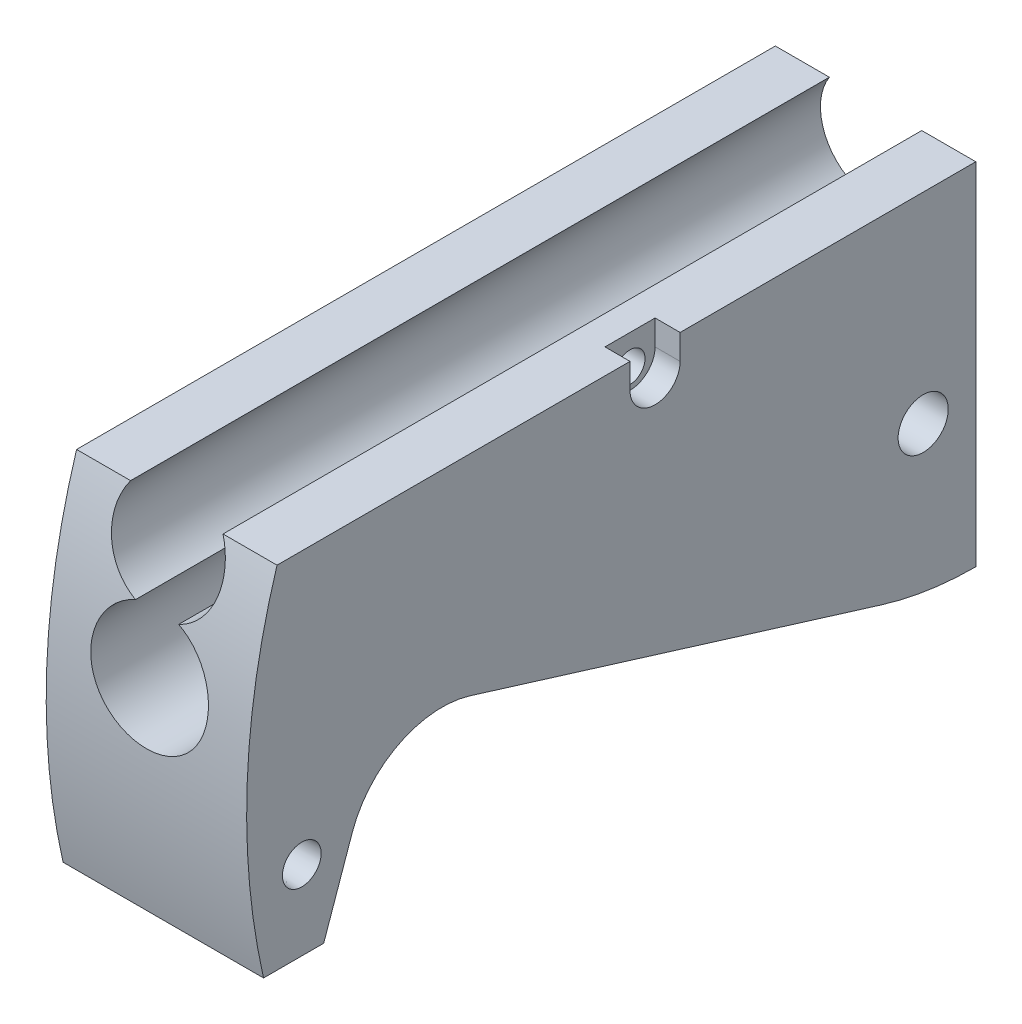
from build123d import *

# Parameters (mm, degrees)
SKETCH1_W                      = 40
SKETCH1_H                      = 70
BOSS_EXTRUDE1_DEPTH            = 147
SKETCH2_OUTSIDE_W              = 182.532
SKETCH2_OUTSIDE_H              = 105.532
SKETCH2_OUTSIDE_R              = 5
CUT_EXTRUDE1_DEPTH             = 147
SKETCH3_R                      = 6
CUT_EXTRUDE2_DEPTH             = 153.427031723
CUT_EXTRUDE6_DEPTH             = 4
SKETCH8_R                      = 11.69
CUT_EXTRUDE7_DEPTH             = 33
SKETCH10_R                     = 6.5
CUT_EXTRUDE8_DEPTH             = 64
SKETCH11_R                     = 3.865
CUT_EXTRUDE10_DEPTH            = 15.2
CUT_EXTRUDE10_DRAFT            = -2.27
F_6_5_6_5_DIAMETER_HOLE1_D     = 6.5
F_6_5_6_5_DIAMETER_HOLE1_DEPTH = 11.4
F_6_5_6_5_DIAMETER_HOLE1_TIP   = 1.952797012
SKETCH14_R                     = 4.05
CUT_EXTRUDE11_DEPTH            = 15.2
CUT_EXTRUDE11_DRAFT            = -3.9
F_6_0_6_DIAMETER_HOLE2_D       = 6
F_6_0_6_DIAMETER_HOLE2_DEPTH   = 10.5
F_6_0_6_DIAMETER_HOLE2_TIP     = 1.802581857
CUT_EXTRUDE12_DEPTH            = 5
CUT_EXTRUDE13_REACH            = 155.689
CUT_EXTRUDE13_END_RADIUS       = 11
SKETCH23_R                     = 3


with BuildPart() as part:
    # Sketch1 → Boss-Extrude1 (new body)
    with BuildSketch(Plane.XY):
        Rectangle(SKETCH1_W, SKETCH1_H)
    extrude(amount=BOSS_EXTRUDE1_DEPTH)

    # Sketch2 outside → Cut-Extrude1 (cut)
    # profile 1 of 2: a face of its own
    with BuildSketch(Plane(origin=(20, 0, 0), x_dir=(0, 0, -1), z_dir=(1, 0, 0))):
        with Locations((-73.5, 0)):
            Rectangle(SKETCH2_OUTSIDE_W, SKETCH2_OUTSIDE_H)
        with BuildLine():
            Line((-130.124465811, -35), (-124.43525745, -18.728912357))
            ThreePointArc((-124.43525745, -18.728912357), (-115.063682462, -8.039359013), (-100.898035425, -6.844615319))
            Line((-100.898035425, -6.844615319), (-18.869775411, -32.154979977))
            ThreePointArc((-18.869775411, -32.154979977), (-9.54152193, -34.284748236), (0, -35))
            Line((0, -35), (0, 35))
            Line((0, 35), (-139.437969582, 35))
            ThreePointArc((-139.437969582, 35), (-145.400688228, 0.177288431), (-142.124465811, -35))
            Line((-142.124465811, -35), (-130.124465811, -35))
        make_face(mode=Mode.SUBTRACT)
    # profile 2 of 2: a face of its own
    with BuildSketch(Plane(origin=(20, 0, 0), x_dir=(0, 0, -1), z_dir=(1, 0, 0))):
        with Locations(Location((-10.5, -5, 0), (0, 0, 90))):
            Circle(SKETCH2_OUTSIDE_R)
    extrude(amount=-CUT_EXTRUDE1_DEPTH, mode=Mode.SUBTRACT)

    # Sketch3 → Cut-Extrude2 (cut, through all)
    with BuildSketch(Plane.XY.offset(147)):
        with Locations((0, 8)):
            Circle(SKETCH3_R)
        with BuildLine():
            Line((-9.219544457, 35), (9.219544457, 35))
            ThreePointArc((9.219544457, 35), (0, 18), (-9.219544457, 35))
        make_face()
    extrude(amount=-CUT_EXTRUDE2_DEPTH, mode=Mode.SUBTRACT)

    # Sketch7 → Cut-Extrude6 (cut)
    with BuildSketch(Plane(origin=(2, 0, 0), x_dir=(0, 0, -1), z_dir=(1, 0, 0))):
        with BuildLine():
            Line((0, -35), (0, 25))
            Line((0, 25), (-63.874877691, 25))
            ThreePointArc((-63.874877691, 25), (-43.8178046, -17.647615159), (0, -35))
        make_face()
    extrude(amount=-CUT_EXTRUDE6_DEPTH, mode=Mode.SUBTRACT)

    # Sketch8 → Cut-Extrude7 (cut)
    with BuildSketch(Plane.XY.offset(147)):
        with Locations((0, 8)):
            Circle(SKETCH8_R)
    extrude(amount=-CUT_EXTRUDE7_DEPTH, mode=Mode.SUBTRACT)

    # Sketch10 → Cut-Extrude8 (cut)
    with BuildSketch(Plane(origin=(0, 0, 0), x_dir=(-1, 0, 0), z_dir=(0, 0, -1))):
        with Locations((0, 8)):
            Circle(SKETCH10_R)
    extrude(amount=-CUT_EXTRUDE8_DEPTH, mode=Mode.SUBTRACT)


with BuildPart() as cut_extrude10_tool:
    # Sketch11 → Cut-Extrude10 (with draft: the straight prism first)
    with BuildSketch(Plane(origin=(20, 0, 0), x_dir=(0, 0, -1), z_dir=(1, 0, 0))):
        with Locations((-134.5, -19.2)):
            Circle(SKETCH11_R)
    extrude(amount=-CUT_EXTRUDE10_DEPTH)
    # Cut-Extrude10: the draft: its side faces are tilted about the plane it starts from
    cut_extrude10_sides = [cut_extrude10_tool.faces().sort_by_distance(p)[0] for p in [
        (12.4, -19.2, 138.365),
    ]]
    draft(cut_extrude10_sides, Plane(origin=(20, 0, 0), x_dir=(0, 0, -1), z_dir=(1, 0, 0)), CUT_EXTRUDE10_DRAFT)


with BuildPart() as part_1:
    add(part.part)

    # Cut-Extrude10: cut by cut_extrude10_tool
    add(cut_extrude10_tool.part, mode=Mode.SUBTRACT)

    # 6.5 _6.5_ Diameter Hole1
    with Locations(Plane(origin=(4.8, 0, 0), x_dir=(0, 0, -1), z_dir=(1, 0, 0))):
        with Locations((-134.5, -19.2)):
            Hole(F_6_5_6_5_DIAMETER_HOLE1_D / 2, depth=F_6_5_6_5_DIAMETER_HOLE1_DEPTH)
            with Locations((0, 0, -(F_6_5_6_5_DIAMETER_HOLE1_DEPTH + F_6_5_6_5_DIAMETER_HOLE1_TIP / 2))):  # 118° drill point
                Cone(0, F_6_5_6_5_DIAMETER_HOLE1_D / 2, F_6_5_6_5_DIAMETER_HOLE1_TIP, mode=Mode.SUBTRACT)


with BuildPart() as cut_extrude11_tool:
    # Sketch14 → Cut-Extrude11 (with draft: the straight prism first)
    with BuildSketch(Plane.ZY.offset(20)):
        with Locations((64, -5)):
            Circle(SKETCH14_R)
    extrude(amount=-CUT_EXTRUDE11_DEPTH)
    # Cut-Extrude11: the draft: its side faces are tilted about the plane it starts from
    cut_extrude11_sides = [cut_extrude11_tool.faces().sort_by_distance(p)[0] for p in [
        (-12.4, -5, 59.95),
    ]]
    draft(cut_extrude11_sides, Plane.ZY.offset(20), CUT_EXTRUDE11_DRAFT)


with BuildPart() as part_2:
    add(part_1.part)

    # Cut-Extrude11: cut by cut_extrude11_tool
    add(cut_extrude11_tool.part, mode=Mode.SUBTRACT)

    # 6.0 _6_ Diameter Hole2
    with Locations(Plane.ZY.offset(4.8)):
        with Locations((64, -5)):
            Hole(F_6_0_6_DIAMETER_HOLE2_D / 2, depth=F_6_0_6_DIAMETER_HOLE2_DEPTH)
            with Locations((0, 0, -(F_6_0_6_DIAMETER_HOLE2_DEPTH + F_6_0_6_DIAMETER_HOLE2_TIP / 2))):  # 118° drill point
                Cone(0, F_6_0_6_DIAMETER_HOLE2_D / 2, F_6_0_6_DIAMETER_HOLE2_TIP, mode=Mode.SUBTRACT)

    # Sketch22 → Cut-Extrude12 (cut)
    with BuildSketch(Plane(origin=(20, 0, 0), x_dir=(0, 0, -1), z_dir=(1, 0, 0))):
        with BuildLine():
            Line((-69, 30), (-69, 35))
            Line((-69, 35), (-59, 35))
            Line((-59, 35), (-59, 30))
            ThreePointArc((-59, 30), (-64, 25), (-69, 30))
        make_face()
    extrude(amount=-CUT_EXTRUDE12_DEPTH, mode=Mode.SUBTRACT)

    # Cut-Extrude13: up to this cylinder (the profile starts outside it)
    cut_extrude13_end = Plane(origin=(0, 29, 64), z_dir=(0, 0, 1)) * Cylinder(CUT_EXTRUDE13_END_RADIUS, 334.378, mode=Mode.PRIVATE)
    # Sketch23 → Cut-Extrude13 (cut, up to the surface)
    with BuildSketch(Plane(origin=(15, 0, 0), x_dir=(0, 0, -1), z_dir=(1, 0, 0)), mode=Mode.PRIVATE) as cut_extrude13_sk1:
        with Locations(Location((-64, 29, 0), (0, 0, 90))):
            Circle(SKETCH23_R)
    cut_extrude13_tool1 = extrude(cut_extrude13_sk1.sketch, amount=-CUT_EXTRUDE13_REACH, mode=Mode.PRIVATE) - cut_extrude13_end
    add(cut_extrude13_tool1.solids().sort_by_distance((15, 29, 64))[0], mode=Mode.SUBTRACT)


solid = part_2.part
